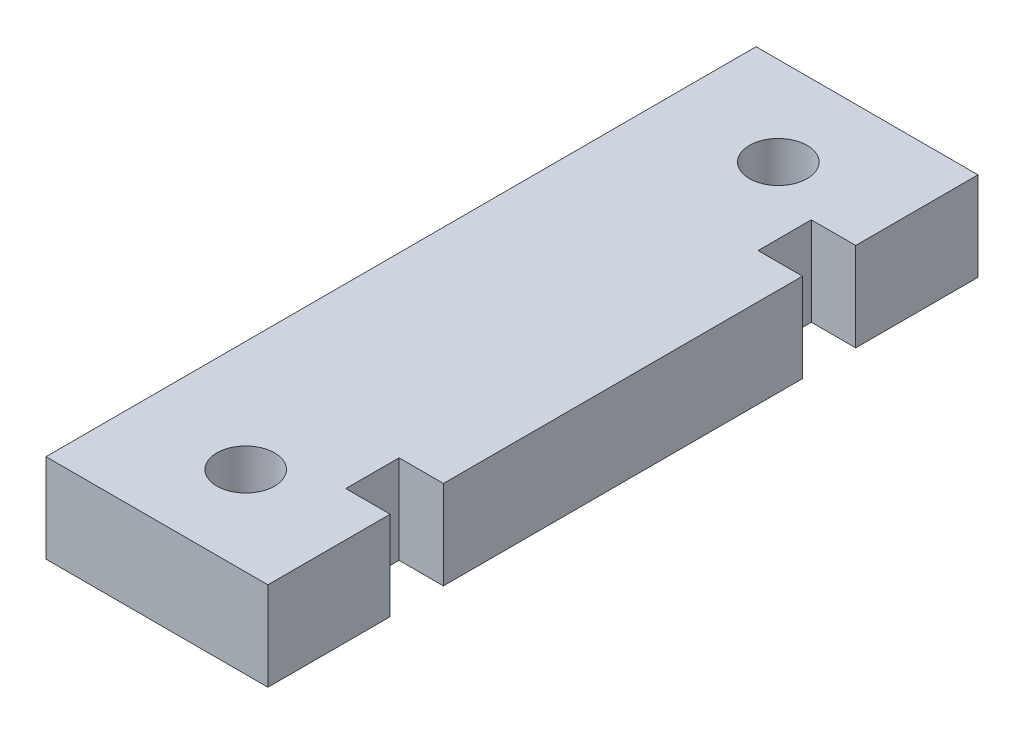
ISO-10303-21;
HEADER;
FILE_DESCRIPTION(('STEP AP214'),'2;1');
FILE_NAME('part.step','',(''),(''),'','','');
FILE_SCHEMA(('AUTOMOTIVE_DESIGN { 1 0 10303 214 1 1 1 1 }'));
ENDSEC;
DATA;
#1=APPLICATION_CONTEXT('core data for automotive mechanical design processes');
#2=APPLICATION_PROTOCOL_DEFINITION('international standard','automotive_design',2000,#1);
#3=PRODUCT_CONTEXT('',#1,'mechanical');
#4=PRODUCT('Part','Part','',(#3));
#5=PRODUCT_RELATED_PRODUCT_CATEGORY('part','',(#4));
#6=PRODUCT_DEFINITION_FORMATION('','',#4);
#7=PRODUCT_DEFINITION_CONTEXT('part definition',#1,'design');
#8=PRODUCT_DEFINITION('design','',#6,#7);
#9=PRODUCT_DEFINITION_SHAPE('','',#8);
#10=(LENGTH_UNIT() NAMED_UNIT(*) SI_UNIT(.MILLI.,.METRE.));
#11=(NAMED_UNIT(*) PLANE_ANGLE_UNIT() SI_UNIT($,.RADIAN.));
#12=(NAMED_UNIT(*) SI_UNIT($,.STERADIAN.) SOLID_ANGLE_UNIT());
#13=UNCERTAINTY_MEASURE_WITH_UNIT(LENGTH_MEASURE(1.E-05),#10,'distance_accuracy_value','');
#14=(GEOMETRIC_REPRESENTATION_CONTEXT(3) GLOBAL_UNCERTAINTY_ASSIGNED_CONTEXT((#13)) GLOBAL_UNIT_ASSIGNED_CONTEXT((#10,
#11,#12)) REPRESENTATION_CONTEXT('',''));
#15=CARTESIAN_POINT('',(0.,0.,0.));
#16=DIRECTION('',(0.,0.,1.));
#17=DIRECTION('',(1.,0.,0.));
#18=AXIS2_PLACEMENT_3D('',#15,#16,#17);
#19=CARTESIAN_POINT('',(25.,0.,-80.));
#20=DIRECTION('',(1.,0.,0.));
#21=DIRECTION('',(0.,0.,-1.));
#22=AXIS2_PLACEMENT_3D('',#19,#20,#21);
#23=PLANE('',#22);
#24=DIRECTION('',(0.,1.,0.));
#25=VECTOR('',#24,1.);
#26=CARTESIAN_POINT('',(25.,10.,-66.2237081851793));
#27=LINE('',#26,#25);
#28=CARTESIAN_POINT('',(25.,0.,-66.2237081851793));
#29=VERTEX_POINT('',#28);
#30=CARTESIAN_POINT('',(25.,10.,-66.2237081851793));
#31=VERTEX_POINT('',#30);
#32=EDGE_CURVE('E135',#29,#31,#27,.T.);
#33=ORIENTED_EDGE('',*,*,#32,.F.);
#34=DIRECTION('',(0.,0.,1.));
#35=VECTOR('',#34,1.);
#36=CARTESIAN_POINT('',(25.,0.,-80.));
#37=LINE('',#36,#35);
#38=CARTESIAN_POINT('',(25.,0.,-80.));
#39=VERTEX_POINT('',#38);
#40=EDGE_CURVE('E146',#39,#29,#37,.T.);
#41=ORIENTED_EDGE('',*,*,#40,.F.);
#42=DIRECTION('',(0.,1.,0.));
#43=VECTOR('',#42,1.);
#44=CARTESIAN_POINT('',(25.,0.,-80.));
#45=LINE('',#44,#43);
#46=CARTESIAN_POINT('',(25.,10.,-80.));
#47=VERTEX_POINT('',#46);
#48=EDGE_CURVE('E162',#39,#47,#45,.T.);
#49=ORIENTED_EDGE('',*,*,#48,.T.);
#50=DIRECTION('',(0.,0.,1.));
#51=VECTOR('',#50,1.);
#52=CARTESIAN_POINT('',(25.,10.,-80.));
#53=LINE('',#52,#51);
#54=EDGE_CURVE('E36',#47,#31,#53,.T.);
#55=ORIENTED_EDGE('',*,*,#54,.T.);
#56=EDGE_LOOP('',(#33,#41,#49,#55));
#57=FACE_BOUND('',#56,.T.);
#58=ADVANCED_FACE('F27',(#57),#23,.T.);
#59=DIRECTION('',(0.,-1.,0.));
#60=VECTOR('',#59,1.);
#61=CARTESIAN_POINT('',(25.,10.,-13.7762918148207));
#62=LINE('',#61,#60);
#63=CARTESIAN_POINT('',(25.,10.,-13.7762918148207));
#64=VERTEX_POINT('',#63);
#65=CARTESIAN_POINT('',(25.,0.,-13.7762918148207));
#66=VERTEX_POINT('',#65);
#67=EDGE_CURVE('E213',#64,#66,#62,.T.);
#68=ORIENTED_EDGE('',*,*,#67,.F.);
#69=CARTESIAN_POINT('',(25.,10.,0.));
#70=VERTEX_POINT('',#69);
#71=EDGE_CURVE('E143',#64,#70,#53,.T.);
#72=ORIENTED_EDGE('',*,*,#71,.T.);
#73=DIRECTION('',(0.,1.,0.));
#74=VECTOR('',#73,1.);
#75=CARTESIAN_POINT('',(25.,0.,0.));
#76=LINE('',#75,#74);
#77=CARTESIAN_POINT('',(25.,0.,0.));
#78=VERTEX_POINT('',#77);
#79=EDGE_CURVE('E174',#78,#70,#76,.T.);
#80=ORIENTED_EDGE('',*,*,#79,.F.);
#81=EDGE_CURVE('E149',#66,#78,#37,.T.);
#82=ORIENTED_EDGE('',*,*,#81,.F.);
#83=EDGE_LOOP('',(#68,#72,#80,#82));
#84=FACE_BOUND('',#83,.T.);
#85=ADVANCED_FACE('F244',(#84),#23,.T.);
#86=CARTESIAN_POINT('',(0.,0.,-80.));
#87=DIRECTION('',(-1.,0.,0.));
#88=DIRECTION('',(0.,0.,1.));
#89=AXIS2_PLACEMENT_3D('',#86,#87,#88);
#90=PLANE('',#89);
#91=DIRECTION('',(0.,-1.,0.));
#92=VECTOR('',#91,1.);
#93=CARTESIAN_POINT('',(0.,0.,0.));
#94=LINE('',#93,#92);
#95=CARTESIAN_POINT('',(0.,10.,0.));
#96=VERTEX_POINT('',#95);
#97=CARTESIAN_POINT('',(0.,0.,0.));
#98=VERTEX_POINT('',#97);
#99=EDGE_CURVE('E180',#96,#98,#94,.T.);
#100=ORIENTED_EDGE('',*,*,#99,.F.);
#101=DIRECTION('',(0.,0.,1.));
#102=VECTOR('',#101,1.);
#103=CARTESIAN_POINT('',(0.,10.,-80.));
#104=LINE('',#103,#102);
#105=CARTESIAN_POINT('',(0.,10.,-80.));
#106=VERTEX_POINT('',#105);
#107=EDGE_CURVE('E11',#106,#96,#104,.T.);
#108=ORIENTED_EDGE('',*,*,#107,.F.);
#109=DIRECTION('',(0.,-1.,0.));
#110=VECTOR('',#109,1.);
#111=CARTESIAN_POINT('',(0.,0.,-80.));
#112=LINE('',#111,#110);
#113=CARTESIAN_POINT('',(0.,0.,-80.));
#114=VERTEX_POINT('',#113);
#115=EDGE_CURVE('E169',#106,#114,#112,.T.);
#116=ORIENTED_EDGE('',*,*,#115,.T.);
#117=DIRECTION('',(0.,0.,1.));
#118=VECTOR('',#117,1.);
#119=CARTESIAN_POINT('',(0.,0.,-80.));
#120=LINE('',#119,#118);
#121=EDGE_CURVE('E31',#114,#98,#120,.T.);
#122=ORIENTED_EDGE('',*,*,#121,.T.);
#123=EDGE_LOOP('',(#100,#108,#116,#122));
#124=FACE_BOUND('',#123,.T.);
#125=ADVANCED_FACE('F29',(#124),#90,.T.);
#126=CARTESIAN_POINT('',(0.,10.,-80.));
#127=DIRECTION('',(0.,1.,0.));
#128=DIRECTION('',(0.,0.,1.));
#129=AXIS2_PLACEMENT_3D('',#126,#127,#128);
#130=PLANE('',#129);
#131=DIRECTION('',(1.,0.,0.));
#132=VECTOR('',#131,1.);
#133=CARTESIAN_POINT('',(20.,10.,-66.2237081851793));
#134=LINE('',#133,#132);
#135=CARTESIAN_POINT('',(20.,10.,-66.2237081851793));
#136=VERTEX_POINT('',#135);
#137=EDGE_CURVE('E214',#136,#31,#134,.T.);
#138=ORIENTED_EDGE('',*,*,#137,.T.);
#139=ORIENTED_EDGE('',*,*,#54,.F.);
#140=DIRECTION('',(-1.,0.,0.));
#141=VECTOR('',#140,1.);
#142=CARTESIAN_POINT('',(0.,10.,-80.));
#143=LINE('',#142,#141);
#144=EDGE_CURVE('E157',#47,#106,#143,.T.);
#145=ORIENTED_EDGE('',*,*,#144,.T.);
#146=ORIENTED_EDGE('',*,*,#107,.T.);
#147=DIRECTION('',(-1.,0.,0.));
#148=VECTOR('',#147,1.);
#149=CARTESIAN_POINT('',(0.,10.,0.));
#150=LINE('',#149,#148);
#151=EDGE_CURVE('E171',#70,#96,#150,.T.);
#152=ORIENTED_EDGE('',*,*,#151,.F.);
#153=ORIENTED_EDGE('',*,*,#71,.F.);
#154=DIRECTION('',(1.,0.,0.));
#155=VECTOR('',#154,1.);
#156=CARTESIAN_POINT('',(20.,10.,-13.7762918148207));
#157=LINE('',#156,#155);
#158=CARTESIAN_POINT('',(20.,10.,-13.7762918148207));
#159=VERTEX_POINT('',#158);
#160=EDGE_CURVE('E195',#159,#64,#157,.T.);
#161=ORIENTED_EDGE('',*,*,#160,.F.);
#162=DIRECTION('',(0.,0.,1.));
#163=VECTOR('',#162,1.);
#164=CARTESIAN_POINT('',(20.,10.,-13.7762918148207));
#165=LINE('',#164,#163);
#166=CARTESIAN_POINT('',(20.,10.,-19.7762918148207));
#167=VERTEX_POINT('',#166);
#168=EDGE_CURVE('E199',#167,#159,#165,.T.);
#169=ORIENTED_EDGE('',*,*,#168,.F.);
#170=DIRECTION('',(1.,0.,0.));
#171=VECTOR('',#170,1.);
#172=CARTESIAN_POINT('',(20.,10.,-19.7762918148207));
#173=LINE('',#172,#171);
#174=CARTESIAN_POINT('',(25.,10.,-19.7762918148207));
#175=VERTEX_POINT('',#174);
#176=EDGE_CURVE('E142',#167,#175,#173,.T.);
#177=ORIENTED_EDGE('',*,*,#176,.T.);
#178=CARTESIAN_POINT('',(25.,10.,-60.2237081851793));
#179=VERTEX_POINT('',#178);
#180=EDGE_CURVE('E132',#179,#175,#53,.T.);
#181=ORIENTED_EDGE('',*,*,#180,.F.);
#182=DIRECTION('',(1.,0.,0.));
#183=VECTOR('',#182,1.);
#184=CARTESIAN_POINT('',(20.,10.,-60.2237081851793));
#185=LINE('',#184,#183);
#186=CARTESIAN_POINT('',(20.,10.,-60.2237081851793));
#187=VERTEX_POINT('',#186);
#188=EDGE_CURVE('E117',#187,#179,#185,.T.);
#189=ORIENTED_EDGE('',*,*,#188,.F.);
#190=DIRECTION('',(0.,0.,1.));
#191=VECTOR('',#190,1.);
#192=CARTESIAN_POINT('',(20.,10.,-66.2237081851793));
#193=LINE('',#192,#191);
#194=EDGE_CURVE('E225',#136,#187,#193,.T.);
#195=ORIENTED_EDGE('',*,*,#194,.F.);
#196=EDGE_LOOP('',(#138,#139,#145,#146,#152,#153,#161,#169,#177,#181,#189,#195));
#197=FACE_BOUND('',#196,.T.);
#198=CARTESIAN_POINT('',(12.5,10.,-9.99999999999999));
#199=DIRECTION('',(0.,1.,0.));
#200=DIRECTION('',(0.,0.,-1.));
#201=AXIS2_PLACEMENT_3D('',#198,#199,#200);
#202=CIRCLE('',#201,3.25);
#203=CARTESIAN_POINT('',(12.5,10.,-13.25));
#204=VERTEX_POINT('',#203);
#205=EDGE_CURVE('E192',#204,#204,#202,.T.);
#206=ORIENTED_EDGE('',*,*,#205,.F.);
#207=EDGE_LOOP('',(#206));
#208=FACE_BOUND('',#207,.T.);
#209=CARTESIAN_POINT('',(12.5,10.,-70.));
#210=DIRECTION('',(0.,1.,0.));
#211=DIRECTION('',(0.,0.,1.));
#212=AXIS2_PLACEMENT_3D('',#209,#210,#211);
#213=CIRCLE('',#212,3.25);
#214=CARTESIAN_POINT('',(12.5,10.,-66.75));
#215=VERTEX_POINT('',#214);
#216=EDGE_CURVE('E186',#215,#215,#213,.T.);
#217=ORIENTED_EDGE('',*,*,#216,.F.);
#218=EDGE_LOOP('',(#217));
#219=FACE_BOUND('',#218,.T.);
#220=ADVANCED_FACE('F139',(#197,#208,#219),#130,.T.);
#221=DIRECTION('',(0.,-1.,0.));
#222=VECTOR('',#221,1.);
#223=CARTESIAN_POINT('',(25.,10.,-60.2237081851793));
#224=LINE('',#223,#222);
#225=CARTESIAN_POINT('',(25.,0.,-60.2237081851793));
#226=VERTEX_POINT('',#225);
#227=EDGE_CURVE('E120',#179,#226,#224,.T.);
#228=ORIENTED_EDGE('',*,*,#227,.F.);
#229=ORIENTED_EDGE('',*,*,#180,.T.);
#230=DIRECTION('',(0.,1.,0.));
#231=VECTOR('',#230,1.);
#232=CARTESIAN_POINT('',(25.,10.,-19.7762918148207));
#233=LINE('',#232,#231);
#234=CARTESIAN_POINT('',(25.,0.,-19.7762918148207));
#235=VERTEX_POINT('',#234);
#236=EDGE_CURVE('E211',#235,#175,#233,.T.);
#237=ORIENTED_EDGE('',*,*,#236,.F.);
#238=EDGE_CURVE('E134',#226,#235,#37,.T.);
#239=ORIENTED_EDGE('',*,*,#238,.F.);
#240=EDGE_LOOP('',(#228,#229,#237,#239));
#241=FACE_BOUND('',#240,.T.);
#242=ADVANCED_FACE('F130',(#241),#23,.T.);
#243=CARTESIAN_POINT('',(0.,0.,-80.));
#244=DIRECTION('',(0.,-1.,0.));
#245=DIRECTION('',(0.,0.,-1.));
#246=AXIS2_PLACEMENT_3D('',#243,#244,#245);
#247=PLANE('',#246);
#248=DIRECTION('',(1.,0.,0.));
#249=VECTOR('',#248,1.);
#250=CARTESIAN_POINT('',(20.,0.,-66.2237081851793));
#251=LINE('',#250,#249);
#252=CARTESIAN_POINT('',(20.,0.,-66.2237081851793));
#253=VERTEX_POINT('',#252);
#254=EDGE_CURVE('E217',#253,#29,#251,.T.);
#255=ORIENTED_EDGE('',*,*,#254,.F.);
#256=DIRECTION('',(0.,0.,-1.));
#257=VECTOR('',#256,1.);
#258=CARTESIAN_POINT('',(20.,0.,-66.2237081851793));
#259=LINE('',#258,#257);
#260=CARTESIAN_POINT('',(20.,0.,-60.2237081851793));
#261=VERTEX_POINT('',#260);
#262=EDGE_CURVE('E222',#261,#253,#259,.T.);
#263=ORIENTED_EDGE('',*,*,#262,.F.);
#264=DIRECTION('',(1.,0.,0.));
#265=VECTOR('',#264,1.);
#266=CARTESIAN_POINT('',(20.,0.,-60.2237081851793));
#267=LINE('',#266,#265);
#268=EDGE_CURVE('E125',#261,#226,#267,.T.);
#269=ORIENTED_EDGE('',*,*,#268,.T.);
#270=ORIENTED_EDGE('',*,*,#238,.T.);
#271=DIRECTION('',(1.,0.,0.));
#272=VECTOR('',#271,1.);
#273=CARTESIAN_POINT('',(20.,0.,-19.7762918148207));
#274=LINE('',#273,#272);
#275=CARTESIAN_POINT('',(20.,0.,-19.7762918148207));
#276=VERTEX_POINT('',#275);
#277=EDGE_CURVE('E198',#276,#235,#274,.T.);
#278=ORIENTED_EDGE('',*,*,#277,.F.);
#279=DIRECTION('',(0.,0.,-1.));
#280=VECTOR('',#279,1.);
#281=CARTESIAN_POINT('',(20.,0.,-13.7762918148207));
#282=LINE('',#281,#280);
#283=CARTESIAN_POINT('',(20.,0.,-13.7762918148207));
#284=VERTEX_POINT('',#283);
#285=EDGE_CURVE('E208',#284,#276,#282,.T.);
#286=ORIENTED_EDGE('',*,*,#285,.F.);
#287=DIRECTION('',(1.,0.,0.));
#288=VECTOR('',#287,1.);
#289=CARTESIAN_POINT('',(20.,0.,-13.7762918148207));
#290=LINE('',#289,#288);
#291=EDGE_CURVE('E196',#284,#66,#290,.T.);
#292=ORIENTED_EDGE('',*,*,#291,.T.);
#293=ORIENTED_EDGE('',*,*,#81,.T.);
#294=DIRECTION('',(1.,0.,0.));
#295=VECTOR('',#294,1.);
#296=CARTESIAN_POINT('',(0.,0.,0.));
#297=LINE('',#296,#295);
#298=EDGE_CURVE('E177',#98,#78,#297,.T.);
#299=ORIENTED_EDGE('',*,*,#298,.F.);
#300=ORIENTED_EDGE('',*,*,#121,.F.);
#301=DIRECTION('',(1.,0.,0.));
#302=VECTOR('',#301,1.);
#303=CARTESIAN_POINT('',(0.,0.,-80.));
#304=LINE('',#303,#302);
#305=EDGE_CURVE('E165',#114,#39,#304,.T.);
#306=ORIENTED_EDGE('',*,*,#305,.T.);
#307=ORIENTED_EDGE('',*,*,#40,.T.);
#308=EDGE_LOOP('',(#255,#263,#269,#270,#278,#286,#292,#293,#299,#300,#306,#307));
#309=FACE_BOUND('',#308,.T.);
#310=CARTESIAN_POINT('',(12.5,0.,-9.99999999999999));
#311=DIRECTION('',(0.,1.,0.));
#312=DIRECTION('',(0.,0.,-1.));
#313=AXIS2_PLACEMENT_3D('',#310,#311,#312);
#314=CIRCLE('',#313,3.25);
#315=CARTESIAN_POINT('',(12.5,0.,-13.25));
#316=VERTEX_POINT('',#315);
#317=EDGE_CURVE('E189',#316,#316,#314,.T.);
#318=ORIENTED_EDGE('',*,*,#317,.T.);
#319=EDGE_LOOP('',(#318));
#320=FACE_BOUND('',#319,.T.);
#321=CARTESIAN_POINT('',(12.5,0.,-70.));
#322=DIRECTION('',(0.,1.,0.));
#323=DIRECTION('',(0.,0.,1.));
#324=AXIS2_PLACEMENT_3D('',#321,#322,#323);
#325=CIRCLE('',#324,3.25);
#326=CARTESIAN_POINT('',(12.5,0.,-66.75));
#327=VERTEX_POINT('',#326);
#328=EDGE_CURVE('E183',#327,#327,#325,.T.);
#329=ORIENTED_EDGE('',*,*,#328,.T.);
#330=EDGE_LOOP('',(#329));
#331=FACE_BOUND('',#330,.T.);
#332=ADVANCED_FACE('F248',(#309,#320,#331),#247,.T.);
#333=CARTESIAN_POINT('',(0.,10.,-80.));
#334=DIRECTION('',(0.,0.,-1.));
#335=DIRECTION('',(-1.,0.,0.));
#336=AXIS2_PLACEMENT_3D('',#333,#334,#335);
#337=PLANE('',#336);
#338=ORIENTED_EDGE('',*,*,#115,.F.);
#339=ORIENTED_EDGE('',*,*,#144,.F.);
#340=ORIENTED_EDGE('',*,*,#48,.F.);
#341=ORIENTED_EDGE('',*,*,#305,.F.);
#342=EDGE_LOOP('',(#338,#339,#340,#341));
#343=FACE_BOUND('',#342,.T.);
#344=ADVANCED_FACE('F236',(#343),#337,.T.);
#345=CARTESIAN_POINT('',(0.,10.,0.));
#346=DIRECTION('',(0.,0.,-1.));
#347=DIRECTION('',(-1.,0.,0.));
#348=AXIS2_PLACEMENT_3D('',#345,#346,#347);
#349=PLANE('',#348);
#350=ORIENTED_EDGE('',*,*,#99,.T.);
#351=ORIENTED_EDGE('',*,*,#298,.T.);
#352=ORIENTED_EDGE('',*,*,#79,.T.);
#353=ORIENTED_EDGE('',*,*,#151,.T.);
#354=EDGE_LOOP('',(#350,#351,#352,#353));
#355=FACE_BOUND('',#354,.T.);
#356=ADVANCED_FACE('F241',(#355),#349,.F.);
#357=CARTESIAN_POINT('',(12.5,0.,-70.));
#358=DIRECTION('',(0.,1.,0.));
#359=DIRECTION('',(0.,0.,1.));
#360=AXIS2_PLACEMENT_3D('',#357,#358,#359);
#361=CYLINDRICAL_SURFACE('',#360,3.25);
#362=ORIENTED_EDGE('',*,*,#328,.F.);
#363=EDGE_LOOP('',(#362));
#364=FACE_BOUND('',#363,.T.);
#365=ORIENTED_EDGE('',*,*,#216,.T.);
#366=EDGE_LOOP('',(#365));
#367=FACE_BOUND('',#366,.T.);
#368=ADVANCED_FACE('F283',(#364,#367),#361,.F.);
#369=CARTESIAN_POINT('',(12.5,0.,-9.99999999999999));
#370=DIRECTION('',(0.,1.,0.));
#371=DIRECTION('',(0.,0.,1.));
#372=AXIS2_PLACEMENT_3D('',#369,#370,#371);
#373=CYLINDRICAL_SURFACE('',#372,3.25);
#374=ORIENTED_EDGE('',*,*,#317,.F.);
#375=EDGE_LOOP('',(#374));
#376=FACE_BOUND('',#375,.T.);
#377=ORIENTED_EDGE('',*,*,#205,.T.);
#378=EDGE_LOOP('',(#377));
#379=FACE_BOUND('',#378,.T.);
#380=ADVANCED_FACE('F261',(#376,#379),#373,.F.);
#381=CARTESIAN_POINT('',(20.,10.,-13.7762918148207));
#382=DIRECTION('',(0.,0.,1.));
#383=DIRECTION('',(1.,0.,0.));
#384=AXIS2_PLACEMENT_3D('',#381,#382,#383);
#385=PLANE('',#384);
#386=ORIENTED_EDGE('',*,*,#67,.T.);
#387=ORIENTED_EDGE('',*,*,#291,.F.);
#388=DIRECTION('',(0.,-1.,0.));
#389=VECTOR('',#388,1.);
#390=CARTESIAN_POINT('',(20.,10.,-13.7762918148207));
#391=LINE('',#390,#389);
#392=EDGE_CURVE('E52',#159,#284,#391,.T.);
#393=ORIENTED_EDGE('',*,*,#392,.F.);
#394=ORIENTED_EDGE('',*,*,#160,.T.);
#395=EDGE_LOOP('',(#386,#387,#393,#394));
#396=FACE_BOUND('',#395,.T.);
#397=ADVANCED_FACE('F246',(#396),#385,.F.);
#398=CARTESIAN_POINT('',(20.,10.,-19.7762918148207));
#399=DIRECTION('',(0.,0.,-1.));
#400=DIRECTION('',(-1.,0.,0.));
#401=AXIS2_PLACEMENT_3D('',#398,#399,#400);
#402=PLANE('',#401);
#403=ORIENTED_EDGE('',*,*,#236,.T.);
#404=ORIENTED_EDGE('',*,*,#176,.F.);
#405=DIRECTION('',(0.,1.,0.));
#406=VECTOR('',#405,1.);
#407=CARTESIAN_POINT('',(20.,10.,-19.7762918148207));
#408=LINE('',#407,#406);
#409=EDGE_CURVE('E205',#276,#167,#408,.T.);
#410=ORIENTED_EDGE('',*,*,#409,.F.);
#411=ORIENTED_EDGE('',*,*,#277,.T.);
#412=EDGE_LOOP('',(#403,#404,#410,#411));
#413=FACE_BOUND('',#412,.T.);
#414=ADVANCED_FACE('F253',(#413),#402,.F.);
#415=CARTESIAN_POINT('',(20.,0.,-13.7762918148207));
#416=DIRECTION('',(1.,0.,0.));
#417=DIRECTION('',(0.,0.,-1.));
#418=AXIS2_PLACEMENT_3D('',#415,#416,#417);
#419=PLANE('',#418);
#420=ORIENTED_EDGE('',*,*,#392,.T.);
#421=ORIENTED_EDGE('',*,*,#285,.T.);
#422=ORIENTED_EDGE('',*,*,#409,.T.);
#423=ORIENTED_EDGE('',*,*,#168,.T.);
#424=EDGE_LOOP('',(#420,#421,#422,#423));
#425=FACE_BOUND('',#424,.T.);
#426=ADVANCED_FACE('F251',(#425),#419,.T.);
#427=CARTESIAN_POINT('',(20.,10.,-66.2237081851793));
#428=DIRECTION('',(0.,0.,-1.));
#429=DIRECTION('',(-1.,0.,0.));
#430=AXIS2_PLACEMENT_3D('',#427,#428,#429);
#431=PLANE('',#430);
#432=ORIENTED_EDGE('',*,*,#32,.T.);
#433=ORIENTED_EDGE('',*,*,#137,.F.);
#434=DIRECTION('',(0.,1.,0.));
#435=VECTOR('',#434,1.);
#436=CARTESIAN_POINT('',(20.,10.,-66.2237081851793));
#437=LINE('',#436,#435);
#438=EDGE_CURVE('E126',#253,#136,#437,.T.);
#439=ORIENTED_EDGE('',*,*,#438,.F.);
#440=ORIENTED_EDGE('',*,*,#254,.T.);
#441=EDGE_LOOP('',(#432,#433,#439,#440));
#442=FACE_BOUND('',#441,.T.);
#443=ADVANCED_FACE('F229',(#442),#431,.F.);
#444=CARTESIAN_POINT('',(20.,10.,-60.2237081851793));
#445=DIRECTION('',(0.,0.,1.));
#446=DIRECTION('',(1.,0.,0.));
#447=AXIS2_PLACEMENT_3D('',#444,#445,#446);
#448=PLANE('',#447);
#449=ORIENTED_EDGE('',*,*,#227,.T.);
#450=ORIENTED_EDGE('',*,*,#268,.F.);
#451=DIRECTION('',(0.,-1.,0.));
#452=VECTOR('',#451,1.);
#453=CARTESIAN_POINT('',(20.,10.,-60.2237081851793));
#454=LINE('',#453,#452);
#455=EDGE_CURVE('E44',#187,#261,#454,.T.);
#456=ORIENTED_EDGE('',*,*,#455,.F.);
#457=ORIENTED_EDGE('',*,*,#188,.T.);
#458=EDGE_LOOP('',(#449,#450,#456,#457));
#459=FACE_BOUND('',#458,.T.);
#460=ADVANCED_FACE('F119',(#459),#448,.F.);
#461=CARTESIAN_POINT('',(20.,10.,-60.2237081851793));
#462=DIRECTION('',(1.,0.,0.));
#463=DIRECTION('',(0.,0.,-1.));
#464=AXIS2_PLACEMENT_3D('',#461,#462,#463);
#465=PLANE('',#464);
#466=ORIENTED_EDGE('',*,*,#194,.T.);
#467=ORIENTED_EDGE('',*,*,#455,.T.);
#468=ORIENTED_EDGE('',*,*,#262,.T.);
#469=ORIENTED_EDGE('',*,*,#438,.T.);
#470=EDGE_LOOP('',(#466,#467,#468,#469));
#471=FACE_BOUND('',#470,.T.);
#472=ADVANCED_FACE('F348',(#471),#465,.T.);
#473=CLOSED_SHELL('',(#58,#85,#125,#220,#242,#332,#344,#356,#368,#380,#397,#414,#426,#443,#460,#472));
#474=MANIFOLD_SOLID_BREP('B2',#473);
#475=ADVANCED_BREP_SHAPE_REPRESENTATION('',(#18,#474),#14);
#476=SHAPE_DEFINITION_REPRESENTATION(#9,#475);
ENDSEC;
END-ISO-10303-21;
